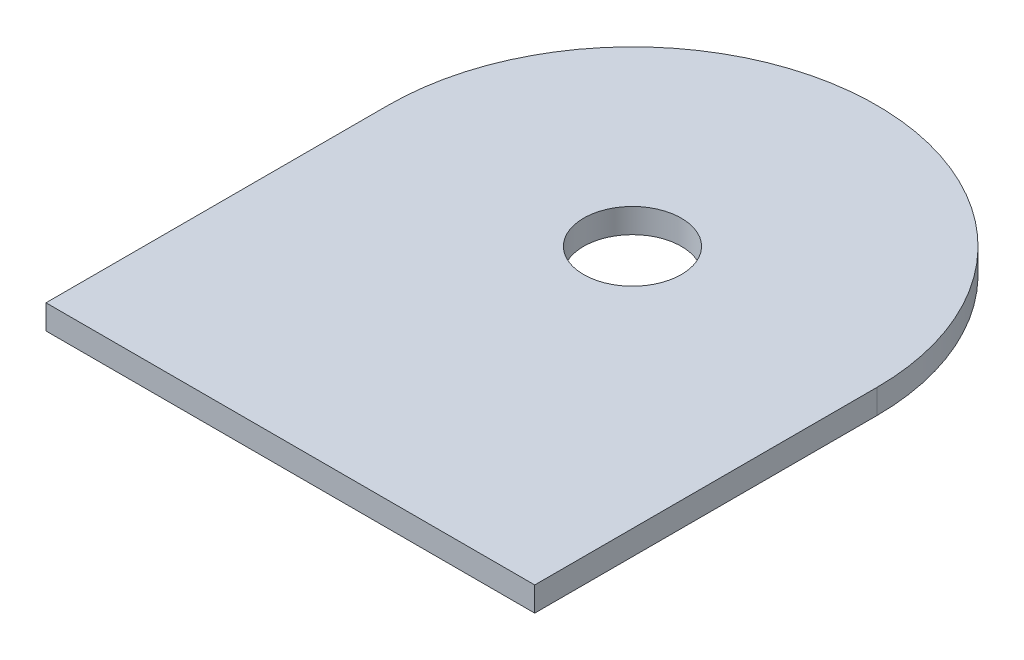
ISO-10303-21;
HEADER;
FILE_DESCRIPTION(('STEP AP214'),'2;1');
FILE_NAME('part.step','',(''),(''),'','','');
FILE_SCHEMA(('AUTOMOTIVE_DESIGN { 1 0 10303 214 1 1 1 1 }'));
ENDSEC;
DATA;
#1=APPLICATION_CONTEXT('core data for automotive mechanical design processes');
#2=APPLICATION_PROTOCOL_DEFINITION('international standard','automotive_design',2000,#1);
#3=PRODUCT_CONTEXT('',#1,'mechanical');
#4=PRODUCT('Part','Part','',(#3));
#5=PRODUCT_RELATED_PRODUCT_CATEGORY('part','',(#4));
#6=PRODUCT_DEFINITION_FORMATION('','',#4);
#7=PRODUCT_DEFINITION_CONTEXT('part definition',#1,'design');
#8=PRODUCT_DEFINITION('design','',#6,#7);
#9=PRODUCT_DEFINITION_SHAPE('','',#8);
#10=(LENGTH_UNIT() NAMED_UNIT(*) SI_UNIT(.MILLI.,.METRE.));
#11=(NAMED_UNIT(*) PLANE_ANGLE_UNIT() SI_UNIT($,.RADIAN.));
#12=(NAMED_UNIT(*) SI_UNIT($,.STERADIAN.) SOLID_ANGLE_UNIT());
#13=UNCERTAINTY_MEASURE_WITH_UNIT(LENGTH_MEASURE(1.E-05),#10,'distance_accuracy_value','');
#14=(GEOMETRIC_REPRESENTATION_CONTEXT(3) GLOBAL_UNCERTAINTY_ASSIGNED_CONTEXT((#13)) GLOBAL_UNIT_ASSIGNED_CONTEXT((#10,
#11,#12)) REPRESENTATION_CONTEXT('',''));
#15=CARTESIAN_POINT('',(0.,0.,0.));
#16=DIRECTION('',(0.,0.,1.));
#17=DIRECTION('',(1.,0.,0.));
#18=AXIS2_PLACEMENT_3D('',#15,#16,#17);
#19=CARTESIAN_POINT('',(0.,2.,0.));
#20=DIRECTION('',(0.,1.,0.));
#21=DIRECTION('',(0.,0.,1.));
#22=AXIS2_PLACEMENT_3D('',#19,#20,#21);
#23=PLANE('',#22);
#24=CARTESIAN_POINT('',(0.,2.,0.));
#25=DIRECTION('',(0.,1.,0.));
#26=DIRECTION('',(0.,0.,1.));
#27=AXIS2_PLACEMENT_3D('',#24,#25,#26);
#28=CIRCLE('',#27,20.);
#29=CARTESIAN_POINT('',(20.,2.,0.));
#30=VERTEX_POINT('',#29);
#31=CARTESIAN_POINT('',(-20.,2.,0.));
#32=VERTEX_POINT('',#31);
#33=EDGE_CURVE('E98',#30,#32,#28,.T.);
#34=ORIENTED_EDGE('',*,*,#33,.T.);
#35=DIRECTION('',(0.,0.,1.));
#36=VECTOR('',#35,1.);
#37=CARTESIAN_POINT('',(-20.,2.,0.));
#38=LINE('',#37,#36);
#39=CARTESIAN_POINT('',(-20.,2.,28.));
#40=VERTEX_POINT('',#39);
#41=EDGE_CURVE('E93',#32,#40,#38,.T.);
#42=ORIENTED_EDGE('',*,*,#41,.T.);
#43=DIRECTION('',(1.,0.,0.));
#44=VECTOR('',#43,1.);
#45=CARTESIAN_POINT('',(20.,2.,28.));
#46=LINE('',#45,#44);
#47=CARTESIAN_POINT('',(20.,2.,28.));
#48=VERTEX_POINT('',#47);
#49=EDGE_CURVE('E96',#40,#48,#46,.T.);
#50=ORIENTED_EDGE('',*,*,#49,.T.);
#51=DIRECTION('',(0.,0.,-1.));
#52=VECTOR('',#51,1.);
#53=CARTESIAN_POINT('',(20.,2.,0.));
#54=LINE('',#53,#52);
#55=EDGE_CURVE('E63',#48,#30,#54,.T.);
#56=ORIENTED_EDGE('',*,*,#55,.T.);
#57=EDGE_LOOP('',(#34,#42,#50,#56));
#58=FACE_BOUND('',#57,.T.);
#59=CARTESIAN_POINT('',(0.,2.,0.));
#60=DIRECTION('',(0.,1.,0.));
#61=DIRECTION('',(0.,0.,1.));
#62=AXIS2_PLACEMENT_3D('',#59,#60,#61);
#63=CIRCLE('',#62,4.);
#64=CARTESIAN_POINT('',(0.,2.,4.));
#65=VERTEX_POINT('',#64);
#66=EDGE_CURVE('E118',#65,#65,#63,.T.);
#67=ORIENTED_EDGE('',*,*,#66,.F.);
#68=EDGE_LOOP('',(#67));
#69=FACE_BOUND('',#68,.T.);
#70=ADVANCED_FACE('F45',(#58,#69),#23,.T.);
#71=CARTESIAN_POINT('',(0.,0.,0.));
#72=DIRECTION('',(0.,1.,0.));
#73=DIRECTION('',(0.,0.,1.));
#74=AXIS2_PLACEMENT_3D('',#71,#72,#73);
#75=PLANE('',#74);
#76=CARTESIAN_POINT('',(0.,0.,0.));
#77=DIRECTION('',(0.,1.,0.));
#78=DIRECTION('',(0.,0.,1.));
#79=AXIS2_PLACEMENT_3D('',#76,#77,#78);
#80=CIRCLE('',#79,20.);
#81=CARTESIAN_POINT('',(20.,0.,0.));
#82=VERTEX_POINT('',#81);
#83=CARTESIAN_POINT('',(-20.,0.,0.));
#84=VERTEX_POINT('',#83);
#85=EDGE_CURVE('E114',#82,#84,#80,.T.);
#86=ORIENTED_EDGE('',*,*,#85,.F.);
#87=DIRECTION('',(0.,0.,-1.));
#88=VECTOR('',#87,1.);
#89=CARTESIAN_POINT('',(20.,0.,0.));
#90=LINE('',#89,#88);
#91=CARTESIAN_POINT('',(20.,0.,28.));
#92=VERTEX_POINT('',#91);
#93=EDGE_CURVE('E86',#92,#82,#90,.T.);
#94=ORIENTED_EDGE('',*,*,#93,.F.);
#95=DIRECTION('',(1.,0.,0.));
#96=VECTOR('',#95,1.);
#97=CARTESIAN_POINT('',(20.,0.,28.));
#98=LINE('',#97,#96);
#99=CARTESIAN_POINT('',(-20.,0.,28.));
#100=VERTEX_POINT('',#99);
#101=EDGE_CURVE('E80',#100,#92,#98,.T.);
#102=ORIENTED_EDGE('',*,*,#101,.F.);
#103=DIRECTION('',(0.,0.,1.));
#104=VECTOR('',#103,1.);
#105=CARTESIAN_POINT('',(-20.,0.,0.));
#106=LINE('',#105,#104);
#107=EDGE_CURVE('E103',#84,#100,#106,.T.);
#108=ORIENTED_EDGE('',*,*,#107,.F.);
#109=EDGE_LOOP('',(#86,#94,#102,#108));
#110=FACE_BOUND('',#109,.T.);
#111=CARTESIAN_POINT('',(0.,0.,0.));
#112=DIRECTION('',(0.,1.,0.));
#113=DIRECTION('',(0.,0.,1.));
#114=AXIS2_PLACEMENT_3D('',#111,#112,#113);
#115=CIRCLE('',#114,4.);
#116=CARTESIAN_POINT('',(0.,0.,4.));
#117=VERTEX_POINT('',#116);
#118=EDGE_CURVE('E136',#117,#117,#115,.T.);
#119=ORIENTED_EDGE('',*,*,#118,.T.);
#120=EDGE_LOOP('',(#119));
#121=FACE_BOUND('',#120,.T.);
#122=ADVANCED_FACE('F131',(#110,#121),#75,.F.);
#123=CARTESIAN_POINT('',(0.,2.,0.));
#124=DIRECTION('',(0.,-1.,0.));
#125=DIRECTION('',(0.,0.,-1.));
#126=AXIS2_PLACEMENT_3D('',#123,#124,#125);
#127=CYLINDRICAL_SURFACE('',#126,20.);
#128=ORIENTED_EDGE('',*,*,#85,.T.);
#129=DIRECTION('',(0.,-1.,0.));
#130=VECTOR('',#129,1.);
#131=CARTESIAN_POINT('',(-20.,2.,0.));
#132=LINE('',#131,#130);
#133=EDGE_CURVE('E11',#32,#84,#132,.T.);
#134=ORIENTED_EDGE('',*,*,#133,.F.);
#135=ORIENTED_EDGE('',*,*,#33,.F.);
#136=DIRECTION('',(0.,-1.,0.));
#137=VECTOR('',#136,1.);
#138=CARTESIAN_POINT('',(20.,2.,0.));
#139=LINE('',#138,#137);
#140=EDGE_CURVE('E110',#30,#82,#139,.T.);
#141=ORIENTED_EDGE('',*,*,#140,.T.);
#142=EDGE_LOOP('',(#128,#134,#135,#141));
#143=FACE_BOUND('',#142,.T.);
#144=ADVANCED_FACE('F47',(#143),#127,.T.);
#145=CARTESIAN_POINT('',(-20.,2.,0.));
#146=DIRECTION('',(1.,0.,0.));
#147=DIRECTION('',(0.,0.,-1.));
#148=AXIS2_PLACEMENT_3D('',#145,#146,#147);
#149=PLANE('',#148);
#150=ORIENTED_EDGE('',*,*,#107,.T.);
#151=DIRECTION('',(0.,-1.,0.));
#152=VECTOR('',#151,1.);
#153=CARTESIAN_POINT('',(-20.,2.,28.));
#154=LINE('',#153,#152);
#155=EDGE_CURVE('E55',#40,#100,#154,.T.);
#156=ORIENTED_EDGE('',*,*,#155,.F.);
#157=ORIENTED_EDGE('',*,*,#41,.F.);
#158=ORIENTED_EDGE('',*,*,#133,.T.);
#159=EDGE_LOOP('',(#150,#156,#157,#158));
#160=FACE_BOUND('',#159,.T.);
#161=ADVANCED_FACE('F102',(#160),#149,.F.);
#162=CARTESIAN_POINT('',(20.,2.,28.));
#163=DIRECTION('',(0.,0.,-1.));
#164=DIRECTION('',(-1.,0.,0.));
#165=AXIS2_PLACEMENT_3D('',#162,#163,#164);
#166=PLANE('',#165);
#167=ORIENTED_EDGE('',*,*,#101,.T.);
#168=DIRECTION('',(0.,-1.,0.));
#169=VECTOR('',#168,1.);
#170=CARTESIAN_POINT('',(20.,2.,28.));
#171=LINE('',#170,#169);
#172=EDGE_CURVE('E105',#48,#92,#171,.T.);
#173=ORIENTED_EDGE('',*,*,#172,.F.);
#174=ORIENTED_EDGE('',*,*,#49,.F.);
#175=ORIENTED_EDGE('',*,*,#155,.T.);
#176=EDGE_LOOP('',(#167,#173,#174,#175));
#177=FACE_BOUND('',#176,.T.);
#178=ADVANCED_FACE('F106',(#177),#166,.F.);
#179=CARTESIAN_POINT('',(20.,2.,0.));
#180=DIRECTION('',(-1.,0.,0.));
#181=DIRECTION('',(0.,0.,1.));
#182=AXIS2_PLACEMENT_3D('',#179,#180,#181);
#183=PLANE('',#182);
#184=ORIENTED_EDGE('',*,*,#93,.T.);
#185=ORIENTED_EDGE('',*,*,#140,.F.);
#186=ORIENTED_EDGE('',*,*,#55,.F.);
#187=ORIENTED_EDGE('',*,*,#172,.T.);
#188=EDGE_LOOP('',(#184,#185,#186,#187));
#189=FACE_BOUND('',#188,.T.);
#190=ADVANCED_FACE('F128',(#189),#183,.F.);
#191=CARTESIAN_POINT('',(0.,2.,0.));
#192=DIRECTION('',(0.,-1.,0.));
#193=DIRECTION('',(0.,0.,-1.));
#194=AXIS2_PLACEMENT_3D('',#191,#192,#193);
#195=CYLINDRICAL_SURFACE('',#194,4.);
#196=ORIENTED_EDGE('',*,*,#66,.T.);
#197=EDGE_LOOP('',(#196));
#198=FACE_BOUND('',#197,.T.);
#199=ORIENTED_EDGE('',*,*,#118,.F.);
#200=EDGE_LOOP('',(#199));
#201=FACE_BOUND('',#200,.T.);
#202=ADVANCED_FACE('F144',(#198,#201),#195,.F.);
#203=CLOSED_SHELL('',(#70,#122,#144,#161,#178,#190,#202));
#204=MANIFOLD_SOLID_BREP('B2',#203);
#205=ADVANCED_BREP_SHAPE_REPRESENTATION('',(#18,#204),#14);
#206=SHAPE_DEFINITION_REPRESENTATION(#9,#205);
ENDSEC;
END-ISO-10303-21;
